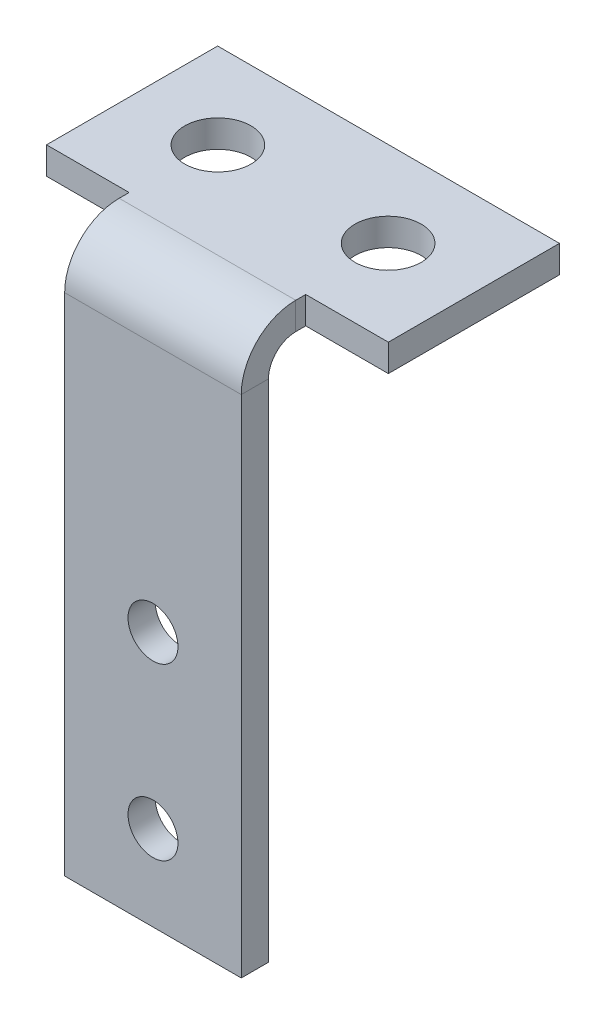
ISO-10303-21;
HEADER;
FILE_DESCRIPTION(('STEP AP214'),'2;1');
FILE_NAME('part.step','',(''),(''),'','','');
FILE_SCHEMA(('AUTOMOTIVE_DESIGN { 1 0 10303 214 1 1 1 1 }'));
ENDSEC;
DATA;
#1=APPLICATION_CONTEXT('core data for automotive mechanical design processes');
#2=APPLICATION_PROTOCOL_DEFINITION('international standard','automotive_design',2000,#1);
#3=PRODUCT_CONTEXT('',#1,'mechanical');
#4=PRODUCT('Part','Part','',(#3));
#5=PRODUCT_RELATED_PRODUCT_CATEGORY('part','',(#4));
#6=PRODUCT_DEFINITION_FORMATION('','',#4);
#7=PRODUCT_DEFINITION_CONTEXT('part definition',#1,'design');
#8=PRODUCT_DEFINITION('design','',#6,#7);
#9=PRODUCT_DEFINITION_SHAPE('','',#8);
#10=(LENGTH_UNIT() NAMED_UNIT(*) SI_UNIT(.MILLI.,.METRE.));
#11=(NAMED_UNIT(*) PLANE_ANGLE_UNIT() SI_UNIT($,.RADIAN.));
#12=(NAMED_UNIT(*) SI_UNIT($,.STERADIAN.) SOLID_ANGLE_UNIT());
#13=UNCERTAINTY_MEASURE_WITH_UNIT(LENGTH_MEASURE(1.E-05),#10,'distance_accuracy_value','');
#14=(GEOMETRIC_REPRESENTATION_CONTEXT(3) GLOBAL_UNCERTAINTY_ASSIGNED_CONTEXT((#13)) GLOBAL_UNIT_ASSIGNED_CONTEXT((#10,
#11,#12)) REPRESENTATION_CONTEXT('',''));
#15=CARTESIAN_POINT('',(0.,0.,0.));
#16=DIRECTION('',(0.,0.,1.));
#17=DIRECTION('',(1.,0.,0.));
#18=AXIS2_PLACEMENT_3D('',#15,#16,#17);
#19=CARTESIAN_POINT('',(4.9403,0.,-3.048));
#20=DIRECTION('',(1.,0.,0.));
#21=DIRECTION('',(0.,0.,-1.));
#22=AXIS2_PLACEMENT_3D('',#19,#20,#21);
#23=PLANE('',#22);
#24=DIRECTION('',(0.,-1.,0.));
#25=VECTOR('',#24,1.);
#26=CARTESIAN_POINT('',(4.9403,0.,-3.048));
#27=LINE('',#26,#25);
#28=CARTESIAN_POINT('',(4.9403,0.,-3.048));
#29=VERTEX_POINT('',#28);
#30=CARTESIAN_POINT('',(4.9403,-1.524,-3.048));
#31=VERTEX_POINT('',#30);
#32=EDGE_CURVE('E44',#29,#31,#27,.T.);
#33=ORIENTED_EDGE('',*,*,#32,.F.);
#34=CARTESIAN_POINT('',(4.9403,-3.048,-3.048));
#35=DIRECTION('',(1.,0.,0.));
#36=DIRECTION('',(0.,0.,-1.));
#37=AXIS2_PLACEMENT_3D('',#34,#35,#36);
#38=CIRCLE('',#37,3.048);
#39=CARTESIAN_POINT('',(4.9403,-3.048,0.));
#40=VERTEX_POINT('',#39);
#41=EDGE_CURVE('E183',#40,#29,#38,.F.);
#42=ORIENTED_EDGE('',*,*,#41,.F.);
#43=DIRECTION('',(0.,0.,1.));
#44=VECTOR('',#43,1.);
#45=CARTESIAN_POINT('',(4.9403,-3.048,-1.524));
#46=LINE('',#45,#44);
#47=CARTESIAN_POINT('',(4.9403,-3.048,-1.524));
#48=VERTEX_POINT('',#47);
#49=EDGE_CURVE('E234',#48,#40,#46,.T.);
#50=ORIENTED_EDGE('',*,*,#49,.F.);
#51=CARTESIAN_POINT('',(4.9403,-3.048,-3.048));
#52=DIRECTION('',(1.,0.,0.));
#53=DIRECTION('',(0.,0.,-1.));
#54=AXIS2_PLACEMENT_3D('',#51,#52,#53);
#55=CIRCLE('',#54,1.524);
#56=EDGE_CURVE('E195',#48,#31,#55,.F.);
#57=ORIENTED_EDGE('',*,*,#56,.T.);
#58=EDGE_LOOP('',(#33,#42,#50,#57));
#59=FACE_BOUND('',#58,.T.);
#60=ADVANCED_FACE('F37',(#59),#23,.T.);
#61=CARTESIAN_POINT('',(4.9403,-3.048,-1.524));
#62=DIRECTION('',(1.,0.,0.));
#63=DIRECTION('',(0.,0.,-1.));
#64=AXIS2_PLACEMENT_3D('',#61,#62,#63);
#65=PLANE('',#64);
#66=DIRECTION('',(0.,-1.,0.));
#67=VECTOR('',#66,1.);
#68=CARTESIAN_POINT('',(4.9403,-3.048,-3.6068));
#69=LINE('',#68,#67);
#70=CARTESIAN_POINT('',(4.9403,0.,-3.6068));
#71=VERTEX_POINT('',#70);
#72=CARTESIAN_POINT('',(4.9403,-1.524,-3.6068));
#73=VERTEX_POINT('',#72);
#74=EDGE_CURVE('E170',#71,#73,#69,.T.);
#75=ORIENTED_EDGE('',*,*,#74,.F.);
#76=DIRECTION('',(0.,0.,-1.));
#77=VECTOR('',#76,1.);
#78=CARTESIAN_POINT('',(4.9403,0.,0.));
#79=LINE('',#78,#77);
#80=EDGE_CURVE('E179',#29,#71,#79,.T.);
#81=ORIENTED_EDGE('',*,*,#80,.F.);
#82=ORIENTED_EDGE('',*,*,#32,.T.);
#83=DIRECTION('',(0.,0.,-1.));
#84=VECTOR('',#83,1.);
#85=CARTESIAN_POINT('',(4.9403,-1.524,0.));
#86=LINE('',#85,#84);
#87=EDGE_CURVE('E176',#31,#73,#86,.T.);
#88=ORIENTED_EDGE('',*,*,#87,.T.);
#89=EDGE_LOOP('',(#75,#81,#82,#88));
#90=FACE_BOUND('',#89,.T.);
#91=ADVANCED_FACE('F238',(#90),#65,.T.);
#92=CARTESIAN_POINT('',(-4.9403,-3.048,0.));
#93=DIRECTION('',(-1.,0.,0.));
#94=DIRECTION('',(0.,0.,1.));
#95=AXIS2_PLACEMENT_3D('',#92,#93,#94);
#96=PLANE('',#95);
#97=DIRECTION('',(0.,0.,-1.));
#98=VECTOR('',#97,1.);
#99=CARTESIAN_POINT('',(-4.9403,-3.048,0.));
#100=LINE('',#99,#98);
#101=CARTESIAN_POINT('',(-4.9403,-3.048,0.));
#102=VERTEX_POINT('',#101);
#103=CARTESIAN_POINT('',(-4.9403,-3.048,-1.524));
#104=VERTEX_POINT('',#103);
#105=EDGE_CURVE('E232',#102,#104,#100,.T.);
#106=ORIENTED_EDGE('',*,*,#105,.F.);
#107=CARTESIAN_POINT('',(-4.9403,-3.048,-3.048));
#108=DIRECTION('',(1.,0.,0.));
#109=DIRECTION('',(0.,0.,-1.));
#110=AXIS2_PLACEMENT_3D('',#107,#108,#109);
#111=CIRCLE('',#110,3.048);
#112=CARTESIAN_POINT('',(-4.9403,0.,-3.048));
#113=VERTEX_POINT('',#112);
#114=EDGE_CURVE('E201',#102,#113,#111,.F.);
#115=ORIENTED_EDGE('',*,*,#114,.T.);
#116=DIRECTION('',(0.,1.,0.));
#117=VECTOR('',#116,1.);
#118=CARTESIAN_POINT('',(-4.9403,-1.524,-3.048));
#119=LINE('',#118,#117);
#120=CARTESIAN_POINT('',(-4.9403,-1.524,-3.048));
#121=VERTEX_POINT('',#120);
#122=EDGE_CURVE('E134',#121,#113,#119,.T.);
#123=ORIENTED_EDGE('',*,*,#122,.F.);
#124=CARTESIAN_POINT('',(-4.9403,-3.048,-3.048));
#125=DIRECTION('',(1.,0.,0.));
#126=DIRECTION('',(0.,0.,-1.));
#127=AXIS2_PLACEMENT_3D('',#124,#125,#126);
#128=CIRCLE('',#127,1.524);
#129=EDGE_CURVE('E180',#104,#121,#128,.F.);
#130=ORIENTED_EDGE('',*,*,#129,.F.);
#131=EDGE_LOOP('',(#106,#115,#123,#130));
#132=FACE_BOUND('',#131,.T.);
#133=ADVANCED_FACE('F272',(#132),#96,.T.);
#134=CARTESIAN_POINT('',(-4.9403,-1.524,-3.048));
#135=DIRECTION('',(-1.,0.,0.));
#136=DIRECTION('',(0.,0.,1.));
#137=AXIS2_PLACEMENT_3D('',#134,#135,#136);
#138=PLANE('',#137);
#139=DIRECTION('',(0.,1.,0.));
#140=VECTOR('',#139,1.);
#141=CARTESIAN_POINT('',(-4.9403,0.,0.));
#142=LINE('',#141,#140);
#143=CARTESIAN_POINT('',(-4.9403,-31.3182,0.));
#144=VERTEX_POINT('',#143);
#145=EDGE_CURVE('E204',#144,#102,#142,.T.);
#146=ORIENTED_EDGE('',*,*,#145,.T.);
#147=ORIENTED_EDGE('',*,*,#105,.T.);
#148=DIRECTION('',(0.,1.,0.));
#149=VECTOR('',#148,1.);
#150=CARTESIAN_POINT('',(-4.9403,0.,-1.524));
#151=LINE('',#150,#149);
#152=CARTESIAN_POINT('',(-4.9403,-31.3182,-1.524));
#153=VERTEX_POINT('',#152);
#154=EDGE_CURVE('E210',#153,#104,#151,.T.);
#155=ORIENTED_EDGE('',*,*,#154,.F.);
#156=DIRECTION('',(0.,0.,1.));
#157=VECTOR('',#156,1.);
#158=CARTESIAN_POINT('',(-4.9403,-31.3182,-1.524));
#159=LINE('',#158,#157);
#160=EDGE_CURVE('E207',#153,#144,#159,.T.);
#161=ORIENTED_EDGE('',*,*,#160,.T.);
#162=EDGE_LOOP('',(#146,#147,#155,#161));
#163=FACE_BOUND('',#162,.T.);
#164=ADVANCED_FACE('F296',(#163),#138,.T.);
#165=CARTESIAN_POINT('',(4.9403,-1.524,0.));
#166=DIRECTION('',(0.,1.,0.));
#167=DIRECTION('',(0.,0.,1.));
#168=AXIS2_PLACEMENT_3D('',#165,#166,#167);
#169=PLANE('',#168);
#170=CARTESIAN_POINT('',(-4.7625,-1.524,-8.3947));
#171=DIRECTION('',(0.,1.,0.));
#172=DIRECTION('',(0.,0.,-1.));
#173=AXIS2_PLACEMENT_3D('',#170,#171,#172);
#174=CIRCLE('',#173,1.8542);
#175=CARTESIAN_POINT('',(-4.7625,-1.524,-6.5405));
#176=VERTEX_POINT('',#175);
#177=EDGE_CURVE('E364',#176,#176,#174,.T.);
#178=ORIENTED_EDGE('',*,*,#177,.T.);
#179=EDGE_LOOP('',(#178));
#180=FACE_BOUND('',#179,.T.);
#181=CARTESIAN_POINT('',(4.7625,-1.524,-8.3947));
#182=DIRECTION('',(0.,1.,0.));
#183=DIRECTION('',(0.,0.,1.));
#184=AXIS2_PLACEMENT_3D('',#181,#182,#183);
#185=CIRCLE('',#184,1.8542);
#186=CARTESIAN_POINT('',(4.7625,-1.524,-6.5405));
#187=VERTEX_POINT('',#186);
#188=EDGE_CURVE('E166',#187,#187,#185,.T.);
#189=ORIENTED_EDGE('',*,*,#188,.T.);
#190=EDGE_LOOP('',(#189));
#191=FACE_BOUND('',#190,.T.);
#192=DIRECTION('',(0.,0.,-1.));
#193=VECTOR('',#192,1.);
#194=CARTESIAN_POINT('',(-4.9403,-1.524,0.));
#195=LINE('',#194,#193);
#196=CARTESIAN_POINT('',(-4.9403,-1.524,-3.60679999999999));
#197=VERTEX_POINT('',#196);
#198=EDGE_CURVE('E175',#121,#197,#195,.T.);
#199=ORIENTED_EDGE('',*,*,#198,.T.);
#200=DIRECTION('',(1.,0.,0.));
#201=VECTOR('',#200,1.);
#202=CARTESIAN_POINT('',(-9.5631,-1.524,-3.60679999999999));
#203=LINE('',#202,#201);
#204=CARTESIAN_POINT('',(-9.5631,-1.524,-3.60679999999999));
#205=VERTEX_POINT('',#204);
#206=EDGE_CURVE('E144',#205,#197,#203,.T.);
#207=ORIENTED_EDGE('',*,*,#206,.F.);
#208=DIRECTION('',(0.,0.,1.));
#209=VECTOR('',#208,1.);
#210=CARTESIAN_POINT('',(-9.5631,-1.524,-3.60679999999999));
#211=LINE('',#210,#209);
#212=CARTESIAN_POINT('',(-9.5631,-1.524,-13.1826));
#213=VERTEX_POINT('',#212);
#214=EDGE_CURVE('E130',#213,#205,#211,.T.);
#215=ORIENTED_EDGE('',*,*,#214,.F.);
#216=DIRECTION('',(-1.,0.,0.));
#217=VECTOR('',#216,1.);
#218=CARTESIAN_POINT('',(4.9403,-1.524,-13.1826));
#219=LINE('',#218,#217);
#220=CARTESIAN_POINT('',(9.56310000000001,-1.524,-13.1826));
#221=VERTEX_POINT('',#220);
#222=EDGE_CURVE('E122',#221,#213,#219,.T.);
#223=ORIENTED_EDGE('',*,*,#222,.F.);
#224=DIRECTION('',(0.,0.,-1.));
#225=VECTOR('',#224,1.);
#226=CARTESIAN_POINT('',(9.56310000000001,-1.524,-3.6068));
#227=LINE('',#226,#225);
#228=CARTESIAN_POINT('',(9.56310000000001,-1.524,-3.6068));
#229=VERTEX_POINT('',#228);
#230=EDGE_CURVE('E127',#229,#221,#227,.T.);
#231=ORIENTED_EDGE('',*,*,#230,.F.);
#232=EDGE_CURVE('E152',#73,#229,#203,.T.);
#233=ORIENTED_EDGE('',*,*,#232,.F.);
#234=ORIENTED_EDGE('',*,*,#87,.F.);
#235=DIRECTION('',(-1.,0.,0.));
#236=VECTOR('',#235,1.);
#237=CARTESIAN_POINT('',(4.9403,-1.524,-3.048));
#238=LINE('',#237,#236);
#239=EDGE_CURVE('E198',#31,#121,#238,.T.);
#240=ORIENTED_EDGE('',*,*,#239,.T.);
#241=EDGE_LOOP('',(#199,#207,#215,#223,#231,#233,#234,#240));
#242=FACE_BOUND('',#241,.T.);
#243=ADVANCED_FACE('F124',(#180,#191,#242),#169,.F.);
#244=CARTESIAN_POINT('',(4.9403,0.,-13.1826));
#245=DIRECTION('',(0.,0.,-1.));
#246=DIRECTION('',(0.,1.,0.));
#247=AXIS2_PLACEMENT_3D('',#244,#245,#246);
#248=PLANE('',#247);
#249=ORIENTED_EDGE('',*,*,#222,.T.);
#250=DIRECTION('',(0.,1.,0.));
#251=VECTOR('',#250,1.);
#252=CARTESIAN_POINT('',(-9.5631,-1.524,-13.1826));
#253=LINE('',#252,#251);
#254=CARTESIAN_POINT('',(-9.5631,0.,-13.1826));
#255=VERTEX_POINT('',#254);
#256=EDGE_CURVE('E143',#213,#255,#253,.T.);
#257=ORIENTED_EDGE('',*,*,#256,.T.);
#258=DIRECTION('',(-1.,0.,0.));
#259=VECTOR('',#258,1.);
#260=CARTESIAN_POINT('',(4.9403,0.,-13.1826));
#261=LINE('',#260,#259);
#262=CARTESIAN_POINT('',(9.56310000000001,0.,-13.1826));
#263=VERTEX_POINT('',#262);
#264=EDGE_CURVE('E135',#263,#255,#261,.T.);
#265=ORIENTED_EDGE('',*,*,#264,.F.);
#266=DIRECTION('',(0.,1.,0.));
#267=VECTOR('',#266,1.);
#268=CARTESIAN_POINT('',(9.56310000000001,-1.524,-13.1826));
#269=LINE('',#268,#267);
#270=EDGE_CURVE('E138',#221,#263,#269,.T.);
#271=ORIENTED_EDGE('',*,*,#270,.F.);
#272=EDGE_LOOP('',(#249,#257,#265,#271));
#273=FACE_BOUND('',#272,.T.);
#274=ADVANCED_FACE('F139',(#273),#248,.T.);
#275=CARTESIAN_POINT('',(4.9403,0.,0.));
#276=DIRECTION('',(0.,1.,0.));
#277=DIRECTION('',(0.,0.,1.));
#278=AXIS2_PLACEMENT_3D('',#275,#276,#277);
#279=PLANE('',#278);
#280=CARTESIAN_POINT('',(-4.7625,0.,-8.3947));
#281=DIRECTION('',(0.,1.,0.));
#282=DIRECTION('',(0.,0.,-1.));
#283=AXIS2_PLACEMENT_3D('',#280,#281,#282);
#284=CIRCLE('',#283,1.8542);
#285=CARTESIAN_POINT('',(-4.7625,0.,-6.5405));
#286=VERTEX_POINT('',#285);
#287=EDGE_CURVE('E361',#286,#286,#284,.T.);
#288=ORIENTED_EDGE('',*,*,#287,.F.);
#289=EDGE_LOOP('',(#288));
#290=FACE_BOUND('',#289,.T.);
#291=CARTESIAN_POINT('',(4.7625,0.,-8.3947));
#292=DIRECTION('',(0.,1.,0.));
#293=DIRECTION('',(0.,0.,1.));
#294=AXIS2_PLACEMENT_3D('',#291,#292,#293);
#295=CIRCLE('',#294,1.8542);
#296=CARTESIAN_POINT('',(4.7625,0.,-6.5405));
#297=VERTEX_POINT('',#296);
#298=EDGE_CURVE('E158',#297,#297,#295,.T.);
#299=ORIENTED_EDGE('',*,*,#298,.F.);
#300=EDGE_LOOP('',(#299));
#301=FACE_BOUND('',#300,.T.);
#302=ORIENTED_EDGE('',*,*,#80,.T.);
#303=DIRECTION('',(1.,0.,0.));
#304=VECTOR('',#303,1.);
#305=CARTESIAN_POINT('',(-9.5631,0.,-3.60679999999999));
#306=LINE('',#305,#304);
#307=CARTESIAN_POINT('',(9.56310000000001,0.,-3.6068));
#308=VERTEX_POINT('',#307);
#309=EDGE_CURVE('E155',#71,#308,#306,.T.);
#310=ORIENTED_EDGE('',*,*,#309,.T.);
#311=DIRECTION('',(0.,0.,-1.));
#312=VECTOR('',#311,1.);
#313=CARTESIAN_POINT('',(9.56310000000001,0.,-3.6068));
#314=LINE('',#313,#312);
#315=EDGE_CURVE('E163',#308,#263,#314,.T.);
#316=ORIENTED_EDGE('',*,*,#315,.T.);
#317=ORIENTED_EDGE('',*,*,#264,.T.);
#318=DIRECTION('',(0.,0.,1.));
#319=VECTOR('',#318,1.);
#320=CARTESIAN_POINT('',(-9.5631,0.,-3.60679999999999));
#321=LINE('',#320,#319);
#322=CARTESIAN_POINT('',(-9.5631,0.,-3.60679999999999));
#323=VERTEX_POINT('',#322);
#324=EDGE_CURVE('E165',#255,#323,#321,.T.);
#325=ORIENTED_EDGE('',*,*,#324,.T.);
#326=CARTESIAN_POINT('',(-4.9403,0.,-3.60679999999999));
#327=VERTEX_POINT('',#326);
#328=EDGE_CURVE('E150',#323,#327,#306,.T.);
#329=ORIENTED_EDGE('',*,*,#328,.T.);
#330=DIRECTION('',(0.,0.,-1.));
#331=VECTOR('',#330,1.);
#332=CARTESIAN_POINT('',(-4.9403,0.,0.));
#333=LINE('',#332,#331);
#334=EDGE_CURVE('E50',#113,#327,#333,.T.);
#335=ORIENTED_EDGE('',*,*,#334,.F.);
#336=DIRECTION('',(-1.,0.,0.));
#337=VECTOR('',#336,1.);
#338=CARTESIAN_POINT('',(4.9403,0.,-3.048));
#339=LINE('',#338,#337);
#340=EDGE_CURVE('E227',#29,#113,#339,.T.);
#341=ORIENTED_EDGE('',*,*,#340,.F.);
#342=EDGE_LOOP('',(#302,#310,#316,#317,#325,#329,#335,#341));
#343=FACE_BOUND('',#342,.T.);
#344=ADVANCED_FACE('F251',(#290,#301,#343),#279,.T.);
#345=CARTESIAN_POINT('',(4.9403,-3.048,-3.048));
#346=DIRECTION('',(-1.,0.,0.));
#347=DIRECTION('',(0.,0.,1.));
#348=AXIS2_PLACEMENT_3D('',#345,#346,#347);
#349=CYLINDRICAL_SURFACE('',#348,3.048);
#350=ORIENTED_EDGE('',*,*,#114,.F.);
#351=DIRECTION('',(-1.,0.,0.));
#352=VECTOR('',#351,1.);
#353=CARTESIAN_POINT('',(4.9403,-3.048,0.));
#354=LINE('',#353,#352);
#355=EDGE_CURVE('E224',#40,#102,#354,.T.);
#356=ORIENTED_EDGE('',*,*,#355,.F.);
#357=ORIENTED_EDGE('',*,*,#41,.T.);
#358=ORIENTED_EDGE('',*,*,#340,.T.);
#359=EDGE_LOOP('',(#350,#356,#357,#358));
#360=FACE_BOUND('',#359,.T.);
#361=ADVANCED_FACE('F254',(#360),#349,.T.);
#362=CARTESIAN_POINT('',(4.9403,0.,0.));
#363=DIRECTION('',(0.,0.,1.));
#364=DIRECTION('',(0.,-1.,0.));
#365=AXIS2_PLACEMENT_3D('',#362,#363,#364);
#366=PLANE('',#365);
#367=CARTESIAN_POINT('',(0.,-17.0307,0.));
#368=DIRECTION('',(0.,0.,1.));
#369=DIRECTION('',(-1.,0.,0.));
#370=AXIS2_PLACEMENT_3D('',#367,#368,#369);
#371=CIRCLE('',#370,1.397);
#372=CARTESIAN_POINT('',(1.397,-17.0307,0.));
#373=VERTEX_POINT('',#372);
#374=EDGE_CURVE('E353',#373,#373,#371,.T.);
#375=ORIENTED_EDGE('',*,*,#374,.F.);
#376=EDGE_LOOP('',(#375));
#377=FACE_BOUND('',#376,.T.);
#378=CARTESIAN_POINT('',(0.,-26.5557,0.));
#379=DIRECTION('',(0.,0.,1.));
#380=DIRECTION('',(1.,0.,0.));
#381=AXIS2_PLACEMENT_3D('',#378,#379,#380);
#382=CIRCLE('',#381,1.397);
#383=CARTESIAN_POINT('',(1.397,-26.5557,0.));
#384=VERTEX_POINT('',#383);
#385=EDGE_CURVE('E355',#384,#384,#382,.T.);
#386=ORIENTED_EDGE('',*,*,#385,.F.);
#387=EDGE_LOOP('',(#386));
#388=FACE_BOUND('',#387,.T.);
#389=ORIENTED_EDGE('',*,*,#145,.F.);
#390=DIRECTION('',(-1.,0.,0.));
#391=VECTOR('',#390,1.);
#392=CARTESIAN_POINT('',(4.9403,-31.3182,0.));
#393=LINE('',#392,#391);
#394=CARTESIAN_POINT('',(4.9403,-31.3182,0.));
#395=VERTEX_POINT('',#394);
#396=EDGE_CURVE('E222',#395,#144,#393,.T.);
#397=ORIENTED_EDGE('',*,*,#396,.F.);
#398=DIRECTION('',(0.,1.,0.));
#399=VECTOR('',#398,1.);
#400=CARTESIAN_POINT('',(4.9403,0.,0.));
#401=LINE('',#400,#399);
#402=EDGE_CURVE('E186',#395,#40,#401,.T.);
#403=ORIENTED_EDGE('',*,*,#402,.T.);
#404=ORIENTED_EDGE('',*,*,#355,.T.);
#405=EDGE_LOOP('',(#389,#397,#403,#404));
#406=FACE_BOUND('',#405,.T.);
#407=ADVANCED_FACE('F259',(#377,#388,#406),#366,.T.);
#408=CARTESIAN_POINT('',(4.9403,-31.3182,-1.524));
#409=DIRECTION('',(0.,-1.,0.));
#410=DIRECTION('',(0.,0.,-1.));
#411=AXIS2_PLACEMENT_3D('',#408,#409,#410);
#412=PLANE('',#411);
#413=ORIENTED_EDGE('',*,*,#160,.F.);
#414=DIRECTION('',(-1.,0.,0.));
#415=VECTOR('',#414,1.);
#416=CARTESIAN_POINT('',(4.9403,-31.3182,-1.524));
#417=LINE('',#416,#415);
#418=CARTESIAN_POINT('',(4.9403,-31.3182,-1.524));
#419=VERTEX_POINT('',#418);
#420=EDGE_CURVE('E220',#419,#153,#417,.T.);
#421=ORIENTED_EDGE('',*,*,#420,.F.);
#422=DIRECTION('',(0.,0.,1.));
#423=VECTOR('',#422,1.);
#424=CARTESIAN_POINT('',(4.9403,-31.3182,-1.524));
#425=LINE('',#424,#423);
#426=EDGE_CURVE('E189',#419,#395,#425,.T.);
#427=ORIENTED_EDGE('',*,*,#426,.T.);
#428=ORIENTED_EDGE('',*,*,#396,.T.);
#429=EDGE_LOOP('',(#413,#421,#427,#428));
#430=FACE_BOUND('',#429,.T.);
#431=ADVANCED_FACE('F265',(#430),#412,.T.);
#432=CARTESIAN_POINT('',(4.9403,0.,-1.524));
#433=DIRECTION('',(0.,0.,1.));
#434=DIRECTION('',(0.,-1.,0.));
#435=AXIS2_PLACEMENT_3D('',#432,#433,#434);
#436=PLANE('',#435);
#437=CARTESIAN_POINT('',(0.,-17.0307,-1.524));
#438=DIRECTION('',(0.,0.,1.));
#439=DIRECTION('',(-1.,0.,0.));
#440=AXIS2_PLACEMENT_3D('',#437,#438,#439);
#441=CIRCLE('',#440,1.397);
#442=CARTESIAN_POINT('',(1.397,-17.0307,-1.524));
#443=VERTEX_POINT('',#442);
#444=EDGE_CURVE('E350',#443,#443,#441,.T.);
#445=ORIENTED_EDGE('',*,*,#444,.T.);
#446=EDGE_LOOP('',(#445));
#447=FACE_BOUND('',#446,.T.);
#448=CARTESIAN_POINT('',(0.,-26.5557,-1.524));
#449=DIRECTION('',(0.,0.,1.));
#450=DIRECTION('',(1.,0.,0.));
#451=AXIS2_PLACEMENT_3D('',#448,#449,#450);
#452=CIRCLE('',#451,1.397);
#453=CARTESIAN_POINT('',(1.397,-26.5557,-1.524));
#454=VERTEX_POINT('',#453);
#455=EDGE_CURVE('E358',#454,#454,#452,.T.);
#456=ORIENTED_EDGE('',*,*,#455,.T.);
#457=EDGE_LOOP('',(#456));
#458=FACE_BOUND('',#457,.T.);
#459=ORIENTED_EDGE('',*,*,#154,.T.);
#460=DIRECTION('',(-1.,0.,0.));
#461=VECTOR('',#460,1.);
#462=CARTESIAN_POINT('',(4.9403,-3.048,-1.524));
#463=LINE('',#462,#461);
#464=EDGE_CURVE('E217',#48,#104,#463,.T.);
#465=ORIENTED_EDGE('',*,*,#464,.F.);
#466=DIRECTION('',(0.,1.,0.));
#467=VECTOR('',#466,1.);
#468=CARTESIAN_POINT('',(4.9403,0.,-1.524));
#469=LINE('',#468,#467);
#470=EDGE_CURVE('E192',#419,#48,#469,.T.);
#471=ORIENTED_EDGE('',*,*,#470,.F.);
#472=ORIENTED_EDGE('',*,*,#420,.T.);
#473=EDGE_LOOP('',(#459,#465,#471,#472));
#474=FACE_BOUND('',#473,.T.);
#475=ADVANCED_FACE('F270',(#447,#458,#474),#436,.F.);
#476=CARTESIAN_POINT('',(4.9403,-3.048,-3.048));
#477=DIRECTION('',(-1.,0.,0.));
#478=DIRECTION('',(0.,0.,1.));
#479=AXIS2_PLACEMENT_3D('',#476,#477,#478);
#480=CYLINDRICAL_SURFACE('',#479,1.524);
#481=ORIENTED_EDGE('',*,*,#129,.T.);
#482=ORIENTED_EDGE('',*,*,#239,.F.);
#483=ORIENTED_EDGE('',*,*,#56,.F.);
#484=ORIENTED_EDGE('',*,*,#464,.T.);
#485=EDGE_LOOP('',(#481,#482,#483,#484));
#486=FACE_BOUND('',#485,.T.);
#487=ADVANCED_FACE('F246',(#486),#480,.F.);
#488=CARTESIAN_POINT('',(4.9403,-3.048,-3.048));
#489=DIRECTION('',(1.,0.,0.));
#490=DIRECTION('',(0.,0.,-1.));
#491=AXIS2_PLACEMENT_3D('',#488,#489,#490);
#492=PLANE('',#491);
#493=ORIENTED_EDGE('',*,*,#470,.T.);
#494=ORIENTED_EDGE('',*,*,#49,.T.);
#495=ORIENTED_EDGE('',*,*,#402,.F.);
#496=ORIENTED_EDGE('',*,*,#426,.F.);
#497=EDGE_LOOP('',(#493,#494,#495,#496));
#498=FACE_BOUND('',#497,.T.);
#499=ADVANCED_FACE('F262',(#498),#492,.T.);
#500=CARTESIAN_POINT('',(-4.9403,-3.048,-3.048));
#501=DIRECTION('',(1.,0.,0.));
#502=DIRECTION('',(0.,0.,-1.));
#503=AXIS2_PLACEMENT_3D('',#500,#501,#502);
#504=PLANE('',#503);
#505=ORIENTED_EDGE('',*,*,#334,.T.);
#506=DIRECTION('',(0.,-1.,0.));
#507=VECTOR('',#506,1.);
#508=CARTESIAN_POINT('',(-4.9403,-3.048,-3.6068));
#509=LINE('',#508,#507);
#510=EDGE_CURVE('E11',#327,#197,#509,.T.);
#511=ORIENTED_EDGE('',*,*,#510,.T.);
#512=ORIENTED_EDGE('',*,*,#198,.F.);
#513=ORIENTED_EDGE('',*,*,#122,.T.);
#514=EDGE_LOOP('',(#505,#511,#512,#513));
#515=FACE_BOUND('',#514,.T.);
#516=ADVANCED_FACE('F273',(#515),#504,.F.);
#517=CARTESIAN_POINT('',(-9.5631,-1.524,-3.60679999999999));
#518=DIRECTION('',(-1.,0.,0.));
#519=DIRECTION('',(0.,0.,1.));
#520=AXIS2_PLACEMENT_3D('',#517,#518,#519);
#521=PLANE('',#520);
#522=ORIENTED_EDGE('',*,*,#324,.F.);
#523=ORIENTED_EDGE('',*,*,#256,.F.);
#524=ORIENTED_EDGE('',*,*,#214,.T.);
#525=DIRECTION('',(0.,1.,0.));
#526=VECTOR('',#525,1.);
#527=CARTESIAN_POINT('',(-9.5631,-1.524,-3.60679999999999));
#528=LINE('',#527,#526);
#529=EDGE_CURVE('E171',#205,#323,#528,.T.);
#530=ORIENTED_EDGE('',*,*,#529,.T.);
#531=EDGE_LOOP('',(#522,#523,#524,#530));
#532=FACE_BOUND('',#531,.T.);
#533=ADVANCED_FACE('F279',(#532),#521,.T.);
#534=CARTESIAN_POINT('',(-9.5631,-1.524,-3.60679999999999));
#535=DIRECTION('',(0.,0.,1.));
#536=DIRECTION('',(1.,0.,0.));
#537=AXIS2_PLACEMENT_3D('',#534,#535,#536);
#538=PLANE('',#537);
#539=ORIENTED_EDGE('',*,*,#510,.F.);
#540=ORIENTED_EDGE('',*,*,#328,.F.);
#541=ORIENTED_EDGE('',*,*,#529,.F.);
#542=ORIENTED_EDGE('',*,*,#206,.T.);
#543=EDGE_LOOP('',(#539,#540,#541,#542));
#544=FACE_BOUND('',#543,.T.);
#545=ADVANCED_FACE('F275',(#544),#538,.T.);
#546=CARTESIAN_POINT('',(9.56310000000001,-1.524,-3.6068));
#547=DIRECTION('',(1.,0.,0.));
#548=DIRECTION('',(0.,0.,-1.));
#549=AXIS2_PLACEMENT_3D('',#546,#547,#548);
#550=PLANE('',#549);
#551=ORIENTED_EDGE('',*,*,#315,.F.);
#552=DIRECTION('',(0.,1.,0.));
#553=VECTOR('',#552,1.);
#554=CARTESIAN_POINT('',(9.56310000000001,-1.524,-3.6068));
#555=LINE('',#554,#553);
#556=EDGE_CURVE('E149',#229,#308,#555,.T.);
#557=ORIENTED_EDGE('',*,*,#556,.F.);
#558=ORIENTED_EDGE('',*,*,#230,.T.);
#559=ORIENTED_EDGE('',*,*,#270,.T.);
#560=EDGE_LOOP('',(#551,#557,#558,#559));
#561=FACE_BOUND('',#560,.T.);
#562=ADVANCED_FACE('F147',(#561),#550,.T.);
#563=ORIENTED_EDGE('',*,*,#309,.F.);
#564=ORIENTED_EDGE('',*,*,#74,.T.);
#565=ORIENTED_EDGE('',*,*,#232,.T.);
#566=ORIENTED_EDGE('',*,*,#556,.T.);
#567=EDGE_LOOP('',(#563,#564,#565,#566));
#568=FACE_BOUND('',#567,.T.);
#569=ADVANCED_FACE('F249',(#568),#538,.T.);
#570=CARTESIAN_POINT('',(4.7625,-1.524,-8.3947));
#571=DIRECTION('',(0.,1.,0.));
#572=DIRECTION('',(0.,0.,1.));
#573=AXIS2_PLACEMENT_3D('',#570,#571,#572);
#574=CYLINDRICAL_SURFACE('',#573,1.8542);
#575=CARTESIAN_POINT('',(4.7625,-1.524,-6.5405));
#576=CARTESIAN_POINT('',(4.7625,-1.508125,-6.5405));
#577=CARTESIAN_POINT('',(4.7625,-1.49225,-6.5405));
#578=CARTESIAN_POINT('',(4.7625,-1.4605,-6.5405));
#579=CARTESIAN_POINT('',(4.7625,-1.444625,-6.5405));
#580=CARTESIAN_POINT('',(4.7625,-1.412875,-6.5405));
#581=CARTESIAN_POINT('',(4.7625,-1.397,-6.5405));
#582=CARTESIAN_POINT('',(4.7625,-1.36525,-6.5405));
#583=CARTESIAN_POINT('',(4.7625,-1.349375,-6.5405));
#584=CARTESIAN_POINT('',(4.7625,-1.317625,-6.5405));
#585=CARTESIAN_POINT('',(4.7625,-1.30175,-6.5405));
#586=CARTESIAN_POINT('',(4.7625,-1.27,-6.5405));
#587=CARTESIAN_POINT('',(4.7625,-1.254125,-6.5405));
#588=CARTESIAN_POINT('',(4.7625,-1.222375,-6.5405));
#589=CARTESIAN_POINT('',(4.7625,-1.2065,-6.5405));
#590=CARTESIAN_POINT('',(4.7625,-1.17475,-6.5405));
#591=CARTESIAN_POINT('',(4.7625,-1.158875,-6.5405));
#592=CARTESIAN_POINT('',(4.7625,-1.127125,-6.5405));
#593=CARTESIAN_POINT('',(4.7625,-1.11125,-6.5405));
#594=CARTESIAN_POINT('',(4.7625,-1.0795,-6.5405));
#595=CARTESIAN_POINT('',(4.7625,-1.063625,-6.5405));
#596=CARTESIAN_POINT('',(4.7625,-1.031875,-6.5405));
#597=CARTESIAN_POINT('',(4.7625,-1.016,-6.5405));
#598=CARTESIAN_POINT('',(4.7625,-0.98425,-6.5405));
#599=CARTESIAN_POINT('',(4.7625,-0.968375,-6.5405));
#600=CARTESIAN_POINT('',(4.7625,-0.936625,-6.5405));
#601=CARTESIAN_POINT('',(4.7625,-0.92075,-6.5405));
#602=CARTESIAN_POINT('',(4.7625,-0.889,-6.5405));
#603=CARTESIAN_POINT('',(4.7625,-0.873125,-6.5405));
#604=CARTESIAN_POINT('',(4.7625,-0.841375,-6.5405));
#605=CARTESIAN_POINT('',(4.7625,-0.8255,-6.5405));
#606=CARTESIAN_POINT('',(4.7625,-0.79375,-6.5405));
#607=CARTESIAN_POINT('',(4.7625,-0.777875,-6.5405));
#608=CARTESIAN_POINT('',(4.7625,-0.746125,-6.5405));
#609=CARTESIAN_POINT('',(4.7625,-0.73025,-6.5405));
#610=CARTESIAN_POINT('',(4.7625,-0.6985,-6.5405));
#611=CARTESIAN_POINT('',(4.7625,-0.682625,-6.5405));
#612=CARTESIAN_POINT('',(4.7625,-0.650875,-6.5405));
#613=CARTESIAN_POINT('',(4.7625,-0.635,-6.5405));
#614=CARTESIAN_POINT('',(4.7625,-0.60325,-6.5405));
#615=CARTESIAN_POINT('',(4.7625,-0.587375,-6.5405));
#616=CARTESIAN_POINT('',(4.7625,-0.555625,-6.5405));
#617=CARTESIAN_POINT('',(4.7625,-0.53975,-6.5405));
#618=CARTESIAN_POINT('',(4.7625,-0.508,-6.5405));
#619=CARTESIAN_POINT('',(4.7625,-0.492125,-6.5405));
#620=CARTESIAN_POINT('',(4.7625,-0.460375,-6.5405));
#621=CARTESIAN_POINT('',(4.7625,-0.4445,-6.5405));
#622=CARTESIAN_POINT('',(4.7625,-0.41275,-6.5405));
#623=CARTESIAN_POINT('',(4.7625,-0.396875,-6.5405));
#624=CARTESIAN_POINT('',(4.7625,-0.365125,-6.5405));
#625=CARTESIAN_POINT('',(4.7625,-0.34925,-6.5405));
#626=CARTESIAN_POINT('',(4.7625,-0.3175,-6.5405));
#627=CARTESIAN_POINT('',(4.7625,-0.301625,-6.5405));
#628=CARTESIAN_POINT('',(4.7625,-0.269875,-6.5405));
#629=CARTESIAN_POINT('',(4.7625,-0.254,-6.5405));
#630=CARTESIAN_POINT('',(4.7625,-0.22225,-6.5405));
#631=CARTESIAN_POINT('',(4.7625,-0.206375,-6.5405));
#632=CARTESIAN_POINT('',(4.7625,-0.174625,-6.5405));
#633=CARTESIAN_POINT('',(4.7625,-0.15875,-6.5405));
#634=CARTESIAN_POINT('',(4.7625,-0.127,-6.5405));
#635=CARTESIAN_POINT('',(4.7625,-0.111125,-6.5405));
#636=CARTESIAN_POINT('',(4.7625,-0.079375,-6.5405));
#637=CARTESIAN_POINT('',(4.7625,-0.0635,-6.5405));
#638=CARTESIAN_POINT('',(4.7625,-0.0317499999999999,-6.5405));
#639=CARTESIAN_POINT('',(4.7625,-0.015875,-6.5405));
#640=CARTESIAN_POINT('',(4.7625,0.,-6.5405));
#641=B_SPLINE_CURVE_WITH_KNOTS('',3,(#575,#576,#577,#578,#579,#580,#581,#582,#583,#584,#585,
#586,#587,#588,#589,#590,#591,#592,#593,#594,#595,#596,#597,#598,#599,#600,#601,#602,#603,#604,
#605,#606,#607,#608,#609,#610,#611,#612,#613,#614,#615,#616,#617,#618,#619,#620,#621,#622,#623,
#624,#625,#626,#627,#628,#629,#630,#631,#632,#633,#634,#635,#636,#637,#638,#639,#640),
.UNSPECIFIED.,.F.,.F.,(4,2,2,2,2,2,2,2,2,2,2,2,2,2,2,2,2,2,2,2,2,2,2,2,2,2,2,2,2,2,2,2,4),(0.,
0.0476249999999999,0.0952499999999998,0.142875,0.1905,0.238125,0.28575,0.333375,0.381,0.428625,
0.47625,0.523875,0.5715,0.619125,0.66675,0.714375,0.762,0.809625,0.85725,0.904875,0.9525,
1.000125,1.04775,1.095375,1.143,1.190625,1.23825,1.285875,1.3335,1.381125,1.42875,1.476375,
1.524),.UNSPECIFIED.);
#642=EDGE_CURVE('BSEAM327',#187,#297,#641,.T.);
#643=ORIENTED_EDGE('',*,*,#188,.F.);
#644=ORIENTED_EDGE('',*,*,#298,.T.);
#645=ORIENTED_EDGE('',*,*,#642,.T.);
#646=ORIENTED_EDGE('',*,*,#642,.F.);
#647=EDGE_LOOP('',(#643,#645,#644,#646));
#648=FACE_BOUND('',#647,.T.);
#649=ADVANCED_FACE('F327',(#648),#574,.F.);
#650=CARTESIAN_POINT('',(-4.7625,-1.524,-8.3947));
#651=DIRECTION('',(0.,1.,0.));
#652=DIRECTION('',(0.,0.,1.));
#653=AXIS2_PLACEMENT_3D('',#650,#651,#652);
#654=CYLINDRICAL_SURFACE('',#653,1.8542);
#655=CARTESIAN_POINT('',(-4.7625,-1.524,-6.5405));
#656=CARTESIAN_POINT('',(-4.7625,-1.508125,-6.5405));
#657=CARTESIAN_POINT('',(-4.7625,-1.49225,-6.5405));
#658=CARTESIAN_POINT('',(-4.7625,-1.4605,-6.5405));
#659=CARTESIAN_POINT('',(-4.7625,-1.444625,-6.5405));
#660=CARTESIAN_POINT('',(-4.7625,-1.412875,-6.5405));
#661=CARTESIAN_POINT('',(-4.7625,-1.397,-6.5405));
#662=CARTESIAN_POINT('',(-4.7625,-1.36525,-6.5405));
#663=CARTESIAN_POINT('',(-4.7625,-1.349375,-6.5405));
#664=CARTESIAN_POINT('',(-4.7625,-1.317625,-6.5405));
#665=CARTESIAN_POINT('',(-4.7625,-1.30175,-6.5405));
#666=CARTESIAN_POINT('',(-4.7625,-1.27,-6.5405));
#667=CARTESIAN_POINT('',(-4.7625,-1.254125,-6.5405));
#668=CARTESIAN_POINT('',(-4.7625,-1.222375,-6.5405));
#669=CARTESIAN_POINT('',(-4.7625,-1.2065,-6.5405));
#670=CARTESIAN_POINT('',(-4.7625,-1.17475,-6.5405));
#671=CARTESIAN_POINT('',(-4.7625,-1.158875,-6.5405));
#672=CARTESIAN_POINT('',(-4.7625,-1.127125,-6.5405));
#673=CARTESIAN_POINT('',(-4.7625,-1.11125,-6.5405));
#674=CARTESIAN_POINT('',(-4.7625,-1.0795,-6.5405));
#675=CARTESIAN_POINT('',(-4.7625,-1.063625,-6.5405));
#676=CARTESIAN_POINT('',(-4.7625,-1.031875,-6.5405));
#677=CARTESIAN_POINT('',(-4.7625,-1.016,-6.5405));
#678=CARTESIAN_POINT('',(-4.7625,-0.98425,-6.5405));
#679=CARTESIAN_POINT('',(-4.7625,-0.968375,-6.5405));
#680=CARTESIAN_POINT('',(-4.7625,-0.936625,-6.5405));
#681=CARTESIAN_POINT('',(-4.7625,-0.92075,-6.5405));
#682=CARTESIAN_POINT('',(-4.7625,-0.889,-6.5405));
#683=CARTESIAN_POINT('',(-4.7625,-0.873125,-6.5405));
#684=CARTESIAN_POINT('',(-4.7625,-0.841375,-6.5405));
#685=CARTESIAN_POINT('',(-4.7625,-0.8255,-6.5405));
#686=CARTESIAN_POINT('',(-4.7625,-0.79375,-6.5405));
#687=CARTESIAN_POINT('',(-4.7625,-0.777875,-6.5405));
#688=CARTESIAN_POINT('',(-4.7625,-0.746125,-6.5405));
#689=CARTESIAN_POINT('',(-4.7625,-0.73025,-6.5405));
#690=CARTESIAN_POINT('',(-4.7625,-0.6985,-6.5405));
#691=CARTESIAN_POINT('',(-4.7625,-0.682625,-6.5405));
#692=CARTESIAN_POINT('',(-4.7625,-0.650875,-6.5405));
#693=CARTESIAN_POINT('',(-4.7625,-0.635,-6.5405));
#694=CARTESIAN_POINT('',(-4.7625,-0.60325,-6.5405));
#695=CARTESIAN_POINT('',(-4.7625,-0.587375,-6.5405));
#696=CARTESIAN_POINT('',(-4.7625,-0.555625,-6.5405));
#697=CARTESIAN_POINT('',(-4.7625,-0.53975,-6.5405));
#698=CARTESIAN_POINT('',(-4.7625,-0.508,-6.5405));
#699=CARTESIAN_POINT('',(-4.7625,-0.492125,-6.5405));
#700=CARTESIAN_POINT('',(-4.7625,-0.460375,-6.5405));
#701=CARTESIAN_POINT('',(-4.7625,-0.4445,-6.5405));
#702=CARTESIAN_POINT('',(-4.7625,-0.41275,-6.5405));
#703=CARTESIAN_POINT('',(-4.7625,-0.396875,-6.5405));
#704=CARTESIAN_POINT('',(-4.7625,-0.365125,-6.5405));
#705=CARTESIAN_POINT('',(-4.7625,-0.34925,-6.5405));
#706=CARTESIAN_POINT('',(-4.7625,-0.3175,-6.5405));
#707=CARTESIAN_POINT('',(-4.7625,-0.301625,-6.5405));
#708=CARTESIAN_POINT('',(-4.7625,-0.269875,-6.5405));
#709=CARTESIAN_POINT('',(-4.7625,-0.254,-6.5405));
#710=CARTESIAN_POINT('',(-4.7625,-0.22225,-6.5405));
#711=CARTESIAN_POINT('',(-4.7625,-0.206375,-6.5405));
#712=CARTESIAN_POINT('',(-4.7625,-0.174625,-6.5405));
#713=CARTESIAN_POINT('',(-4.7625,-0.15875,-6.5405));
#714=CARTESIAN_POINT('',(-4.7625,-0.127,-6.5405));
#715=CARTESIAN_POINT('',(-4.7625,-0.111125,-6.5405));
#716=CARTESIAN_POINT('',(-4.7625,-0.079375,-6.5405));
#717=CARTESIAN_POINT('',(-4.7625,-0.0635,-6.5405));
#718=CARTESIAN_POINT('',(-4.7625,-0.0317499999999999,-6.5405));
#719=CARTESIAN_POINT('',(-4.7625,-0.015875,-6.5405));
#720=CARTESIAN_POINT('',(-4.7625,0.,-6.5405));
#721=B_SPLINE_CURVE_WITH_KNOTS('',3,(#655,#656,#657,#658,#659,#660,#661,#662,#663,#664,#665,
#666,#667,#668,#669,#670,#671,#672,#673,#674,#675,#676,#677,#678,#679,#680,#681,#682,#683,#684,
#685,#686,#687,#688,#689,#690,#691,#692,#693,#694,#695,#696,#697,#698,#699,#700,#701,#702,#703,
#704,#705,#706,#707,#708,#709,#710,#711,#712,#713,#714,#715,#716,#717,#718,#719,#720),
.UNSPECIFIED.,.F.,.F.,(4,2,2,2,2,2,2,2,2,2,2,2,2,2,2,2,2,2,2,2,2,2,2,2,2,2,2,2,2,2,2,2,4),(0.,
0.0476249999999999,0.0952499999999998,0.142875,0.1905,0.238125,0.28575,0.333375,0.381,0.428625,
0.47625,0.523875,0.5715,0.619125,0.66675,0.714375,0.762,0.809625,0.85725,0.904875,0.9525,
1.000125,1.04775,1.095375,1.143,1.190625,1.23825,1.285875,1.3335,1.381125,1.42875,1.476375,
1.524),.UNSPECIFIED.);
#722=EDGE_CURVE('BSEAM331',#176,#286,#721,.T.);
#723=ORIENTED_EDGE('',*,*,#177,.F.);
#724=ORIENTED_EDGE('',*,*,#287,.T.);
#725=ORIENTED_EDGE('',*,*,#722,.T.);
#726=ORIENTED_EDGE('',*,*,#722,.F.);
#727=EDGE_LOOP('',(#723,#725,#724,#726));
#728=FACE_BOUND('',#727,.T.);
#729=ADVANCED_FACE('F331',(#728),#654,.F.);
#730=CARTESIAN_POINT('',(0.,-26.5557,-1.524));
#731=DIRECTION('',(0.,0.,1.));
#732=DIRECTION('',(1.,0.,0.));
#733=AXIS2_PLACEMENT_3D('',#730,#731,#732);
#734=CYLINDRICAL_SURFACE('',#733,1.397);
#735=CARTESIAN_POINT('',(1.397,-26.5557,-1.524));
#736=CARTESIAN_POINT('',(1.397,-26.5557,-1.508125));
#737=CARTESIAN_POINT('',(1.397,-26.5557,-1.49225));
#738=CARTESIAN_POINT('',(1.397,-26.5557,-1.4605));
#739=CARTESIAN_POINT('',(1.397,-26.5557,-1.444625));
#740=CARTESIAN_POINT('',(1.397,-26.5557,-1.412875));
#741=CARTESIAN_POINT('',(1.397,-26.5557,-1.397));
#742=CARTESIAN_POINT('',(1.397,-26.5557,-1.36525));
#743=CARTESIAN_POINT('',(1.397,-26.5557,-1.349375));
#744=CARTESIAN_POINT('',(1.397,-26.5557,-1.317625));
#745=CARTESIAN_POINT('',(1.397,-26.5557,-1.30175));
#746=CARTESIAN_POINT('',(1.397,-26.5557,-1.27));
#747=CARTESIAN_POINT('',(1.397,-26.5557,-1.254125));
#748=CARTESIAN_POINT('',(1.397,-26.5557,-1.222375));
#749=CARTESIAN_POINT('',(1.397,-26.5557,-1.2065));
#750=CARTESIAN_POINT('',(1.397,-26.5557,-1.17475));
#751=CARTESIAN_POINT('',(1.397,-26.5557,-1.158875));
#752=CARTESIAN_POINT('',(1.397,-26.5557,-1.127125));
#753=CARTESIAN_POINT('',(1.397,-26.5557,-1.11125));
#754=CARTESIAN_POINT('',(1.397,-26.5557,-1.0795));
#755=CARTESIAN_POINT('',(1.397,-26.5557,-1.063625));
#756=CARTESIAN_POINT('',(1.397,-26.5557,-1.031875));
#757=CARTESIAN_POINT('',(1.397,-26.5557,-1.016));
#758=CARTESIAN_POINT('',(1.397,-26.5557,-0.98425));
#759=CARTESIAN_POINT('',(1.397,-26.5557,-0.968375));
#760=CARTESIAN_POINT('',(1.397,-26.5557,-0.936625));
#761=CARTESIAN_POINT('',(1.397,-26.5557,-0.92075));
#762=CARTESIAN_POINT('',(1.397,-26.5557,-0.889));
#763=CARTESIAN_POINT('',(1.397,-26.5557,-0.873125));
#764=CARTESIAN_POINT('',(1.397,-26.5557,-0.841375));
#765=CARTESIAN_POINT('',(1.397,-26.5557,-0.8255));
#766=CARTESIAN_POINT('',(1.397,-26.5557,-0.79375));
#767=CARTESIAN_POINT('',(1.397,-26.5557,-0.777875));
#768=CARTESIAN_POINT('',(1.397,-26.5557,-0.746125));
#769=CARTESIAN_POINT('',(1.397,-26.5557,-0.73025));
#770=CARTESIAN_POINT('',(1.397,-26.5557,-0.6985));
#771=CARTESIAN_POINT('',(1.397,-26.5557,-0.682625));
#772=CARTESIAN_POINT('',(1.397,-26.5557,-0.650875));
#773=CARTESIAN_POINT('',(1.397,-26.5557,-0.635));
#774=CARTESIAN_POINT('',(1.397,-26.5557,-0.60325));
#775=CARTESIAN_POINT('',(1.397,-26.5557,-0.587375));
#776=CARTESIAN_POINT('',(1.397,-26.5557,-0.555625));
#777=CARTESIAN_POINT('',(1.397,-26.5557,-0.53975));
#778=CARTESIAN_POINT('',(1.397,-26.5557,-0.508));
#779=CARTESIAN_POINT('',(1.397,-26.5557,-0.492125));
#780=CARTESIAN_POINT('',(1.397,-26.5557,-0.460375));
#781=CARTESIAN_POINT('',(1.397,-26.5557,-0.4445));
#782=CARTESIAN_POINT('',(1.397,-26.5557,-0.41275));
#783=CARTESIAN_POINT('',(1.397,-26.5557,-0.396875));
#784=CARTESIAN_POINT('',(1.397,-26.5557,-0.365125));
#785=CARTESIAN_POINT('',(1.397,-26.5557,-0.34925));
#786=CARTESIAN_POINT('',(1.397,-26.5557,-0.3175));
#787=CARTESIAN_POINT('',(1.397,-26.5557,-0.301625));
#788=CARTESIAN_POINT('',(1.397,-26.5557,-0.269875));
#789=CARTESIAN_POINT('',(1.397,-26.5557,-0.254));
#790=CARTESIAN_POINT('',(1.397,-26.5557,-0.22225));
#791=CARTESIAN_POINT('',(1.397,-26.5557,-0.206375));
#792=CARTESIAN_POINT('',(1.397,-26.5557,-0.174625));
#793=CARTESIAN_POINT('',(1.397,-26.5557,-0.15875));
#794=CARTESIAN_POINT('',(1.397,-26.5557,-0.127));
#795=CARTESIAN_POINT('',(1.397,-26.5557,-0.111125));
#796=CARTESIAN_POINT('',(1.397,-26.5557,-0.079375));
#797=CARTESIAN_POINT('',(1.397,-26.5557,-0.0635));
#798=CARTESIAN_POINT('',(1.397,-26.5557,-0.0317499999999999));
#799=CARTESIAN_POINT('',(1.397,-26.5557,-0.015875));
#800=CARTESIAN_POINT('',(1.397,-26.5557,0.));
#801=B_SPLINE_CURVE_WITH_KNOTS('',3,(#735,#736,#737,#738,#739,#740,#741,#742,#743,#744,#745,
#746,#747,#748,#749,#750,#751,#752,#753,#754,#755,#756,#757,#758,#759,#760,#761,#762,#763,#764,
#765,#766,#767,#768,#769,#770,#771,#772,#773,#774,#775,#776,#777,#778,#779,#780,#781,#782,#783,
#784,#785,#786,#787,#788,#789,#790,#791,#792,#793,#794,#795,#796,#797,#798,#799,#800),
.UNSPECIFIED.,.F.,.F.,(4,2,2,2,2,2,2,2,2,2,2,2,2,2,2,2,2,2,2,2,2,2,2,2,2,2,2,2,2,2,2,2,4),(0.,
0.0476249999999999,0.0952499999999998,0.142875,0.1905,0.238125,0.28575,0.333375,0.381,0.428625,
0.47625,0.523875,0.5715,0.619125,0.66675,0.714375,0.762,0.809625,0.85725,0.904875,0.9525,
1.000125,1.04775,1.095375,1.143,1.190625,1.23825,1.285875,1.3335,1.381125,1.42875,1.476375,
1.524),.UNSPECIFIED.);
#802=EDGE_CURVE('BSEAM337',#454,#384,#801,.T.);
#803=ORIENTED_EDGE('',*,*,#455,.F.);
#804=ORIENTED_EDGE('',*,*,#385,.T.);
#805=ORIENTED_EDGE('',*,*,#802,.T.);
#806=ORIENTED_EDGE('',*,*,#802,.F.);
#807=EDGE_LOOP('',(#803,#805,#804,#806));
#808=FACE_BOUND('',#807,.T.);
#809=ADVANCED_FACE('F337',(#808),#734,.F.);
#810=CARTESIAN_POINT('',(0.,-17.0307,-1.524));
#811=DIRECTION('',(0.,0.,1.));
#812=DIRECTION('',(1.,0.,0.));
#813=AXIS2_PLACEMENT_3D('',#810,#811,#812);
#814=CYLINDRICAL_SURFACE('',#813,1.397);
#815=CARTESIAN_POINT('',(1.397,-17.0307,-1.524));
#816=CARTESIAN_POINT('',(1.397,-17.0307,-1.508125));
#817=CARTESIAN_POINT('',(1.397,-17.0307,-1.49225));
#818=CARTESIAN_POINT('',(1.397,-17.0307,-1.4605));
#819=CARTESIAN_POINT('',(1.397,-17.0307,-1.444625));
#820=CARTESIAN_POINT('',(1.397,-17.0307,-1.412875));
#821=CARTESIAN_POINT('',(1.397,-17.0307,-1.397));
#822=CARTESIAN_POINT('',(1.397,-17.0307,-1.36525));
#823=CARTESIAN_POINT('',(1.397,-17.0307,-1.349375));
#824=CARTESIAN_POINT('',(1.397,-17.0307,-1.317625));
#825=CARTESIAN_POINT('',(1.397,-17.0307,-1.30175));
#826=CARTESIAN_POINT('',(1.397,-17.0307,-1.27));
#827=CARTESIAN_POINT('',(1.397,-17.0307,-1.254125));
#828=CARTESIAN_POINT('',(1.397,-17.0307,-1.222375));
#829=CARTESIAN_POINT('',(1.397,-17.0307,-1.2065));
#830=CARTESIAN_POINT('',(1.397,-17.0307,-1.17475));
#831=CARTESIAN_POINT('',(1.397,-17.0307,-1.158875));
#832=CARTESIAN_POINT('',(1.397,-17.0307,-1.127125));
#833=CARTESIAN_POINT('',(1.397,-17.0307,-1.11125));
#834=CARTESIAN_POINT('',(1.397,-17.0307,-1.0795));
#835=CARTESIAN_POINT('',(1.397,-17.0307,-1.063625));
#836=CARTESIAN_POINT('',(1.397,-17.0307,-1.031875));
#837=CARTESIAN_POINT('',(1.397,-17.0307,-1.016));
#838=CARTESIAN_POINT('',(1.397,-17.0307,-0.98425));
#839=CARTESIAN_POINT('',(1.397,-17.0307,-0.968375));
#840=CARTESIAN_POINT('',(1.397,-17.0307,-0.936625));
#841=CARTESIAN_POINT('',(1.397,-17.0307,-0.92075));
#842=CARTESIAN_POINT('',(1.397,-17.0307,-0.889));
#843=CARTESIAN_POINT('',(1.397,-17.0307,-0.873125));
#844=CARTESIAN_POINT('',(1.397,-17.0307,-0.841375));
#845=CARTESIAN_POINT('',(1.397,-17.0307,-0.8255));
#846=CARTESIAN_POINT('',(1.397,-17.0307,-0.79375));
#847=CARTESIAN_POINT('',(1.397,-17.0307,-0.777875));
#848=CARTESIAN_POINT('',(1.397,-17.0307,-0.746125));
#849=CARTESIAN_POINT('',(1.397,-17.0307,-0.73025));
#850=CARTESIAN_POINT('',(1.397,-17.0307,-0.6985));
#851=CARTESIAN_POINT('',(1.397,-17.0307,-0.682625));
#852=CARTESIAN_POINT('',(1.397,-17.0307,-0.650875));
#853=CARTESIAN_POINT('',(1.397,-17.0307,-0.635));
#854=CARTESIAN_POINT('',(1.397,-17.0307,-0.60325));
#855=CARTESIAN_POINT('',(1.397,-17.0307,-0.587375));
#856=CARTESIAN_POINT('',(1.397,-17.0307,-0.555625));
#857=CARTESIAN_POINT('',(1.397,-17.0307,-0.53975));
#858=CARTESIAN_POINT('',(1.397,-17.0307,-0.508));
#859=CARTESIAN_POINT('',(1.397,-17.0307,-0.492125));
#860=CARTESIAN_POINT('',(1.397,-17.0307,-0.460375));
#861=CARTESIAN_POINT('',(1.397,-17.0307,-0.4445));
#862=CARTESIAN_POINT('',(1.397,-17.0307,-0.41275));
#863=CARTESIAN_POINT('',(1.397,-17.0307,-0.396875));
#864=CARTESIAN_POINT('',(1.397,-17.0307,-0.365125));
#865=CARTESIAN_POINT('',(1.397,-17.0307,-0.34925));
#866=CARTESIAN_POINT('',(1.397,-17.0307,-0.3175));
#867=CARTESIAN_POINT('',(1.397,-17.0307,-0.301625));
#868=CARTESIAN_POINT('',(1.397,-17.0307,-0.269875));
#869=CARTESIAN_POINT('',(1.397,-17.0307,-0.254));
#870=CARTESIAN_POINT('',(1.397,-17.0307,-0.22225));
#871=CARTESIAN_POINT('',(1.397,-17.0307,-0.206375));
#872=CARTESIAN_POINT('',(1.397,-17.0307,-0.174625));
#873=CARTESIAN_POINT('',(1.397,-17.0307,-0.15875));
#874=CARTESIAN_POINT('',(1.397,-17.0307,-0.127));
#875=CARTESIAN_POINT('',(1.397,-17.0307,-0.111125));
#876=CARTESIAN_POINT('',(1.397,-17.0307,-0.079375));
#877=CARTESIAN_POINT('',(1.397,-17.0307,-0.0635));
#878=CARTESIAN_POINT('',(1.397,-17.0307,-0.0317499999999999));
#879=CARTESIAN_POINT('',(1.397,-17.0307,-0.015875));
#880=CARTESIAN_POINT('',(1.397,-17.0307,0.));
#881=B_SPLINE_CURVE_WITH_KNOTS('',3,(#815,#816,#817,#818,#819,#820,#821,#822,#823,#824,#825,
#826,#827,#828,#829,#830,#831,#832,#833,#834,#835,#836,#837,#838,#839,#840,#841,#842,#843,#844,
#845,#846,#847,#848,#849,#850,#851,#852,#853,#854,#855,#856,#857,#858,#859,#860,#861,#862,#863,
#864,#865,#866,#867,#868,#869,#870,#871,#872,#873,#874,#875,#876,#877,#878,#879,#880),
.UNSPECIFIED.,.F.,.F.,(4,2,2,2,2,2,2,2,2,2,2,2,2,2,2,2,2,2,2,2,2,2,2,2,2,2,2,2,2,2,2,2,4),(0.,
0.0476249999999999,0.0952499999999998,0.142875,0.1905,0.238125,0.28575,0.333375,0.381,0.428625,
0.47625,0.523875,0.5715,0.619125,0.66675,0.714375,0.762,0.809625,0.85725,0.904875,0.9525,
1.000125,1.04775,1.095375,1.143,1.190625,1.23825,1.285875,1.3335,1.381125,1.42875,1.476375,
1.524),.UNSPECIFIED.);
#882=EDGE_CURVE('BSEAM341',#443,#373,#881,.T.);
#883=ORIENTED_EDGE('',*,*,#444,.F.);
#884=ORIENTED_EDGE('',*,*,#374,.T.);
#885=ORIENTED_EDGE('',*,*,#882,.T.);
#886=ORIENTED_EDGE('',*,*,#882,.F.);
#887=EDGE_LOOP('',(#883,#885,#884,#886));
#888=FACE_BOUND('',#887,.T.);
#889=ADVANCED_FACE('F341',(#888),#814,.F.);
#890=CLOSED_SHELL('',(#60,#91,#133,#164,#243,#274,#344,#361,#407,#431,#475,#487,#499,#516,#533,
#545,#562,#569,#649,#729,#809,#889));
#891=MANIFOLD_SOLID_BREP('B2',#890);
#892=ADVANCED_BREP_SHAPE_REPRESENTATION('',(#18,#891),#14);
#893=SHAPE_DEFINITION_REPRESENTATION(#9,#892);
ENDSEC;
END-ISO-10303-21;
